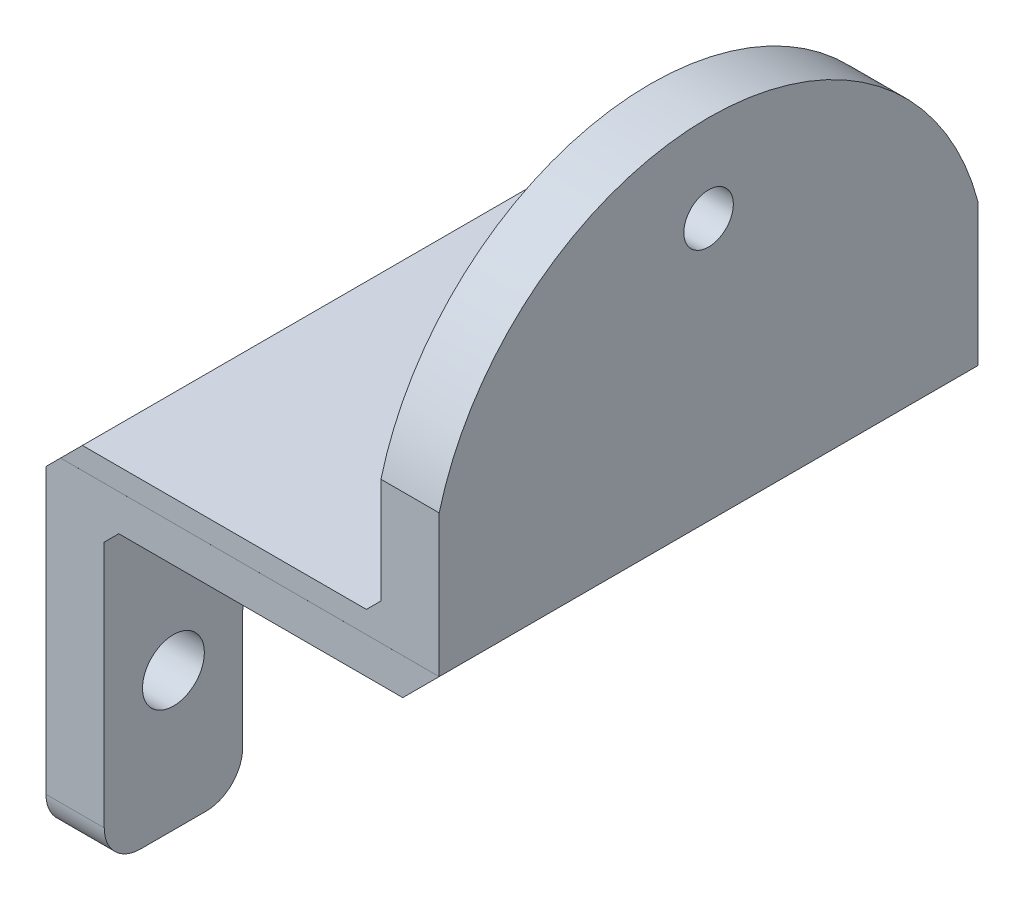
ISO-10303-21;
HEADER;
FILE_DESCRIPTION(('STEP AP214'),'2;1');
FILE_NAME('part.step','',(''),(''),'','','');
FILE_SCHEMA(('AUTOMOTIVE_DESIGN { 1 0 10303 214 1 1 1 1 }'));
ENDSEC;
DATA;
#1=APPLICATION_CONTEXT('core data for automotive mechanical design processes');
#2=APPLICATION_PROTOCOL_DEFINITION('international standard','automotive_design',2000,#1);
#3=PRODUCT_CONTEXT('',#1,'mechanical');
#4=PRODUCT('Part','Part','',(#3));
#5=PRODUCT_RELATED_PRODUCT_CATEGORY('part','',(#4));
#6=PRODUCT_DEFINITION_FORMATION('','',#4);
#7=PRODUCT_DEFINITION_CONTEXT('part definition',#1,'design');
#8=PRODUCT_DEFINITION('design','',#6,#7);
#9=PRODUCT_DEFINITION_SHAPE('','',#8);
#10=(LENGTH_UNIT() NAMED_UNIT(*) SI_UNIT(.MILLI.,.METRE.));
#11=(NAMED_UNIT(*) PLANE_ANGLE_UNIT() SI_UNIT($,.RADIAN.));
#12=(NAMED_UNIT(*) SI_UNIT($,.STERADIAN.) SOLID_ANGLE_UNIT());
#13=UNCERTAINTY_MEASURE_WITH_UNIT(LENGTH_MEASURE(1.E-05),#10,'distance_accuracy_value','');
#14=(GEOMETRIC_REPRESENTATION_CONTEXT(3) GLOBAL_UNCERTAINTY_ASSIGNED_CONTEXT((#13)) GLOBAL_UNIT_ASSIGNED_CONTEXT((#10,
#11,#12)) REPRESENTATION_CONTEXT('',''));
#15=CARTESIAN_POINT('',(0.,0.,0.));
#16=DIRECTION('',(0.,0.,1.));
#17=DIRECTION('',(1.,0.,0.));
#18=AXIS2_PLACEMENT_3D('',#15,#16,#17);
#19=CARTESIAN_POINT('',(54.,41.,37.));
#20=DIRECTION('',(-1.,0.,0.));
#21=DIRECTION('',(0.,0.,1.));
#22=AXIS2_PLACEMENT_3D('',#19,#20,#21);
#23=PLANE('',#22);
#24=CARTESIAN_POINT('',(54.,82.,0.));
#25=DIRECTION('',(1.,0.,0.));
#26=DIRECTION('',(0.,0.,-1.));
#27=AXIS2_PLACEMENT_3D('',#24,#25,#26);
#28=CIRCLE('',#27,3.39999999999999);
#29=CARTESIAN_POINT('',(54.,82.,-3.39999999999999));
#30=VERTEX_POINT('',#29);
#31=EDGE_CURVE('E325',#30,#30,#28,.T.);
#32=ORIENTED_EDGE('',*,*,#31,.F.);
#33=EDGE_LOOP('',(#32));
#34=FACE_BOUND('',#33,.T.);
#35=CARTESIAN_POINT('',(54.,55.74,0.));
#36=DIRECTION('',(-1.,0.,0.));
#37=DIRECTION('',(0.,0.,-1.));
#38=AXIS2_PLACEMENT_3D('',#35,#36,#37);
#39=CIRCLE('',#38,38.26);
#40=CARTESIAN_POINT('',(54.,65.4779463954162,37.));
#41=VERTEX_POINT('',#40);
#42=CARTESIAN_POINT('',(54.,65.4779463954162,-37.));
#43=VERTEX_POINT('',#42);
#44=EDGE_CURVE('E52',#41,#43,#39,.T.);
#45=ORIENTED_EDGE('',*,*,#44,.F.);
#46=DIRECTION('',(0.,1.,0.));
#47=VECTOR('',#46,1.);
#48=CARTESIAN_POINT('',(54.,41.,37.));
#49=LINE('',#48,#47);
#50=CARTESIAN_POINT('',(54.,46.0020536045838,37.));
#51=VERTEX_POINT('',#50);
#52=EDGE_CURVE('E374',#51,#41,#49,.T.);
#53=ORIENTED_EDGE('',*,*,#52,.F.);
#54=CARTESIAN_POINT('',(54.,46.,36.999459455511));
#55=VERTEX_POINT('',#54);
#56=EDGE_CURVE('E218',#55,#51,#39,.T.);
#57=ORIENTED_EDGE('',*,*,#56,.F.);
#58=DIRECTION('',(0.,0.,-1.));
#59=VECTOR('',#58,1.);
#60=CARTESIAN_POINT('',(54.,46.,37.));
#61=LINE('',#60,#59);
#62=CARTESIAN_POINT('',(54.,46.,-36.999459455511));
#63=VERTEX_POINT('',#62);
#64=EDGE_CURVE('E235',#55,#63,#61,.T.);
#65=ORIENTED_EDGE('',*,*,#64,.T.);
#66=CARTESIAN_POINT('',(54.,46.0020536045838,-37.));
#67=VERTEX_POINT('',#66);
#68=EDGE_CURVE('E497',#67,#63,#39,.T.);
#69=ORIENTED_EDGE('',*,*,#68,.F.);
#70=DIRECTION('',(0.,1.,0.));
#71=VECTOR('',#70,1.);
#72=CARTESIAN_POINT('',(54.,41.,-37.));
#73=LINE('',#72,#71);
#74=EDGE_CURVE('E313',#67,#43,#73,.T.);
#75=ORIENTED_EDGE('',*,*,#74,.T.);
#76=EDGE_LOOP('',(#45,#53,#57,#65,#69,#75));
#77=FACE_BOUND('',#76,.T.);
#78=ADVANCED_FACE('F37',(#34,#77),#23,.F.);
#79=CARTESIAN_POINT('',(46.,49.,37.));
#80=DIRECTION('',(1.,0.,0.));
#81=DIRECTION('',(0.,0.,-1.));
#82=AXIS2_PLACEMENT_3D('',#79,#80,#81);
#83=PLANE('',#82);
#84=CARTESIAN_POINT('',(46.,82.,0.));
#85=DIRECTION('',(1.,0.,0.));
#86=DIRECTION('',(0.,0.,-1.));
#87=AXIS2_PLACEMENT_3D('',#84,#85,#86);
#88=CIRCLE('',#87,3.39999999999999);
#89=CARTESIAN_POINT('',(46.,82.,-3.39999999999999));
#90=VERTEX_POINT('',#89);
#91=EDGE_CURVE('E329',#90,#90,#88,.T.);
#92=ORIENTED_EDGE('',*,*,#91,.T.);
#93=EDGE_LOOP('',(#92));
#94=FACE_BOUND('',#93,.T.);
#95=CARTESIAN_POINT('',(46.,55.74,0.));
#96=DIRECTION('',(1.,0.,0.));
#97=DIRECTION('',(0.,0.,-1.));
#98=AXIS2_PLACEMENT_3D('',#95,#96,#97);
#99=CIRCLE('',#98,38.26);
#100=CARTESIAN_POINT('',(46.,65.4779463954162,-37.));
#101=VERTEX_POINT('',#100);
#102=CARTESIAN_POINT('',(46.,65.4779463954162,37.));
#103=VERTEX_POINT('',#102);
#104=EDGE_CURVE('E323',#101,#103,#99,.T.);
#105=ORIENTED_EDGE('',*,*,#104,.F.);
#106=DIRECTION('',(0.,-1.,0.));
#107=VECTOR('',#106,1.);
#108=CARTESIAN_POINT('',(46.,49.,-37.));
#109=LINE('',#108,#107);
#110=CARTESIAN_POINT('',(46.,51.,-37.));
#111=VERTEX_POINT('',#110);
#112=EDGE_CURVE('E384',#101,#111,#109,.T.);
#113=ORIENTED_EDGE('',*,*,#112,.T.);
#114=DIRECTION('',(0.,0.,1.));
#115=VECTOR('',#114,1.);
#116=CARTESIAN_POINT('',(46.,51.,37.));
#117=LINE('',#116,#115);
#118=CARTESIAN_POINT('',(46.,51.,37.));
#119=VERTEX_POINT('',#118);
#120=EDGE_CURVE('E268',#111,#119,#117,.T.);
#121=ORIENTED_EDGE('',*,*,#120,.T.);
#122=DIRECTION('',(0.,-1.,0.));
#123=VECTOR('',#122,1.);
#124=CARTESIAN_POINT('',(46.,49.,37.));
#125=LINE('',#124,#123);
#126=EDGE_CURVE('E302',#103,#119,#125,.T.);
#127=ORIENTED_EDGE('',*,*,#126,.F.);
#128=EDGE_LOOP('',(#105,#113,#121,#127));
#129=FACE_BOUND('',#128,.T.);
#130=ADVANCED_FACE('F518',(#94,#129),#83,.F.);
#131=CARTESIAN_POINT('',(0.,0.,37.));
#132=DIRECTION('',(0.,0.,-1.));
#133=DIRECTION('',(-1.,0.,0.));
#134=AXIS2_PLACEMENT_3D('',#131,#132,#133);
#135=PLANE('',#134);
#136=DIRECTION('',(-1.,0.,0.));
#137=VECTOR('',#136,1.);
#138=CARTESIAN_POINT('',(54.,46.,37.));
#139=LINE('',#138,#137);
#140=CARTESIAN_POINT('',(54.,46.,37.));
#141=VERTEX_POINT('',#140);
#142=CARTESIAN_POINT('',(2.00000000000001,46.,37.));
#143=VERTEX_POINT('',#142);
#144=EDGE_CURVE('E208',#141,#143,#139,.T.);
#145=ORIENTED_EDGE('',*,*,#144,.T.);
#146=DIRECTION('',(0.707106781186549,0.707106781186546,0.));
#147=VECTOR('',#146,1.);
#148=CARTESIAN_POINT('',(0.,44.,37.));
#149=LINE('',#148,#147);
#150=CARTESIAN_POINT('',(0.,44.,37.));
#151=VERTEX_POINT('',#150);
#152=EDGE_CURVE('E250',#143,#151,#149,.F.);
#153=ORIENTED_EDGE('',*,*,#152,.T.);
#154=DIRECTION('',(0.,-1.,0.));
#155=VECTOR('',#154,1.);
#156=CARTESIAN_POINT('',(0.,0.,37.));
#157=LINE('',#156,#155);
#158=CARTESIAN_POINT('',(0.,5.,37.));
#159=VERTEX_POINT('',#158);
#160=EDGE_CURVE('E368',#151,#159,#157,.T.);
#161=ORIENTED_EDGE('',*,*,#160,.T.);
#162=DIRECTION('',(1.,0.,0.));
#163=VECTOR('',#162,1.);
#164=CARTESIAN_POINT('',(0.,5.,37.));
#165=LINE('',#164,#163);
#166=CARTESIAN_POINT('',(8.,5.,37.));
#167=VERTEX_POINT('',#166);
#168=EDGE_CURVE('E394',#159,#167,#165,.T.);
#169=ORIENTED_EDGE('',*,*,#168,.T.);
#170=DIRECTION('',(0.,1.,0.));
#171=VECTOR('',#170,1.);
#172=CARTESIAN_POINT('',(8.,0.,37.));
#173=LINE('',#172,#171);
#174=CARTESIAN_POINT('',(8.,39.,37.));
#175=VERTEX_POINT('',#174);
#176=EDGE_CURVE('E370',#167,#175,#173,.T.);
#177=ORIENTED_EDGE('',*,*,#176,.T.);
#178=DIRECTION('',(-0.70710678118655,-0.707106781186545,0.));
#179=VECTOR('',#178,1.);
#180=CARTESIAN_POINT('',(-15.5,15.5000000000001,37.));
#181=LINE('',#180,#179);
#182=CARTESIAN_POINT('',(10.,41.,37.));
#183=VERTEX_POINT('',#182);
#184=EDGE_CURVE('E273',#175,#183,#181,.F.);
#185=ORIENTED_EDGE('',*,*,#184,.T.);
#186=DIRECTION('',(1.,0.,0.));
#187=VECTOR('',#186,1.);
#188=CARTESIAN_POINT('',(8.,41.,37.));
#189=LINE('',#188,#187);
#190=CARTESIAN_POINT('',(49.,41.,37.));
#191=VERTEX_POINT('',#190);
#192=EDGE_CURVE('E224',#183,#191,#189,.T.);
#193=ORIENTED_EDGE('',*,*,#192,.T.);
#194=DIRECTION('',(-0.707106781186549,-0.707106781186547,0.));
#195=VECTOR('',#194,1.);
#196=CARTESIAN_POINT('',(54.,46.,37.));
#197=LINE('',#196,#195);
#198=EDGE_CURVE('E221',#191,#141,#197,.F.);
#199=ORIENTED_EDGE('',*,*,#198,.T.);
#200=EDGE_LOOP('',(#145,#153,#161,#169,#177,#185,#193,#199));
#201=FACE_BOUND('',#200,.T.);
#202=ADVANCED_FACE('F222',(#201),#135,.F.);
#203=DIRECTION('',(-1.,0.,0.));
#204=VECTOR('',#203,1.);
#205=CARTESIAN_POINT('',(54.,46.0020536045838,37.));
#206=LINE('',#205,#204);
#207=CARTESIAN_POINT('',(2.00205360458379,46.0020536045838,37.));
#208=VERTEX_POINT('',#207);
#209=EDGE_CURVE('E294',#51,#208,#206,.T.);
#210=ORIENTED_EDGE('',*,*,#209,.F.);
#211=ORIENTED_EDGE('',*,*,#52,.T.);
#212=DIRECTION('',(-1.,0.,0.));
#213=VECTOR('',#212,1.);
#214=CARTESIAN_POINT('',(54.,65.4779463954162,37.));
#215=LINE('',#214,#213);
#216=EDGE_CURVE('E322',#103,#41,#215,.F.);
#217=ORIENTED_EDGE('',*,*,#216,.F.);
#218=ORIENTED_EDGE('',*,*,#126,.T.);
#219=DIRECTION('',(0.70710678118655,0.707106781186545,0.));
#220=VECTOR('',#219,1.);
#221=CARTESIAN_POINT('',(-2.50000000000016,2.50000000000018,37.));
#222=LINE('',#221,#220);
#223=CARTESIAN_POINT('',(44.,49.,37.));
#224=VERTEX_POINT('',#223);
#225=EDGE_CURVE('E278',#119,#224,#222,.F.);
#226=ORIENTED_EDGE('',*,*,#225,.T.);
#227=DIRECTION('',(-1.,0.,0.));
#228=VECTOR('',#227,1.);
#229=CARTESIAN_POINT('',(0.,49.,37.));
#230=LINE('',#229,#228);
#231=CARTESIAN_POINT('',(5.00000000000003,49.,37.));
#232=VERTEX_POINT('',#231);
#233=EDGE_CURVE('E297',#224,#232,#230,.T.);
#234=ORIENTED_EDGE('',*,*,#233,.T.);
#235=EDGE_CURVE('E229',#232,#208,#149,.F.);
#236=ORIENTED_EDGE('',*,*,#235,.T.);
#237=EDGE_LOOP('',(#210,#211,#217,#218,#226,#234,#236));
#238=FACE_BOUND('',#237,.T.);
#239=ADVANCED_FACE('F292',(#238),#135,.F.);
#240=CARTESIAN_POINT('',(0.,0.,-37.));
#241=DIRECTION('',(0.,0.,-1.));
#242=DIRECTION('',(-1.,0.,0.));
#243=AXIS2_PLACEMENT_3D('',#240,#241,#242);
#244=PLANE('',#243);
#245=ORIENTED_EDGE('',*,*,#74,.F.);
#246=DIRECTION('',(-1.,0.,0.));
#247=VECTOR('',#246,1.);
#248=CARTESIAN_POINT('',(54.,46.0020536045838,-37.));
#249=LINE('',#248,#247);
#250=CARTESIAN_POINT('',(2.00205360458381,46.0020536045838,-37.));
#251=VERTEX_POINT('',#250);
#252=EDGE_CURVE('E217',#67,#251,#249,.T.);
#253=ORIENTED_EDGE('',*,*,#252,.T.);
#254=DIRECTION('',(-0.707106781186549,-0.707106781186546,0.));
#255=VECTOR('',#254,1.);
#256=CARTESIAN_POINT('',(-22.,22.0000000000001,-37.));
#257=LINE('',#256,#255);
#258=CARTESIAN_POINT('',(5.00000000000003,49.,-37.));
#259=VERTEX_POINT('',#258);
#260=EDGE_CURVE('E236',#251,#259,#257,.F.);
#261=ORIENTED_EDGE('',*,*,#260,.T.);
#262=DIRECTION('',(-1.,0.,0.));
#263=VECTOR('',#262,1.);
#264=CARTESIAN_POINT('',(0.,49.,-37.));
#265=LINE('',#264,#263);
#266=CARTESIAN_POINT('',(44.,49.,-37.));
#267=VERTEX_POINT('',#266);
#268=EDGE_CURVE('E307',#267,#259,#265,.T.);
#269=ORIENTED_EDGE('',*,*,#268,.F.);
#270=DIRECTION('',(-0.70710678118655,-0.707106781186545,0.));
#271=VECTOR('',#270,1.);
#272=CARTESIAN_POINT('',(44.,49.,-37.));
#273=LINE('',#272,#271);
#274=EDGE_CURVE('E275',#267,#111,#273,.F.);
#275=ORIENTED_EDGE('',*,*,#274,.T.);
#276=ORIENTED_EDGE('',*,*,#112,.F.);
#277=DIRECTION('',(-1.,0.,0.));
#278=VECTOR('',#277,1.);
#279=CARTESIAN_POINT('',(54.,65.4779463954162,-37.));
#280=LINE('',#279,#278);
#281=EDGE_CURVE('E317',#101,#43,#280,.F.);
#282=ORIENTED_EDGE('',*,*,#281,.T.);
#283=EDGE_LOOP('',(#245,#253,#261,#269,#275,#276,#282));
#284=FACE_BOUND('',#283,.T.);
#285=ADVANCED_FACE('F311',(#284),#244,.T.);
#286=CARTESIAN_POINT('',(0.,44.,-37.));
#287=VERTEX_POINT('',#286);
#288=CARTESIAN_POINT('',(2.00000000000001,46.,-37.));
#289=VERTEX_POINT('',#288);
#290=EDGE_CURVE('E238',#287,#289,#257,.F.);
#291=ORIENTED_EDGE('',*,*,#290,.T.);
#292=DIRECTION('',(-1.,0.,0.));
#293=VECTOR('',#292,1.);
#294=CARTESIAN_POINT('',(54.,46.,-37.));
#295=LINE('',#294,#293);
#296=CARTESIAN_POINT('',(54.,46.,-37.));
#297=VERTEX_POINT('',#296);
#298=EDGE_CURVE('E60',#297,#289,#295,.T.);
#299=ORIENTED_EDGE('',*,*,#298,.F.);
#300=DIRECTION('',(0.707106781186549,0.707106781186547,0.));
#301=VECTOR('',#300,1.);
#302=CARTESIAN_POINT('',(3.99999999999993,-3.99999999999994,-37.));
#303=LINE('',#302,#301);
#304=CARTESIAN_POINT('',(49.,41.,-37.));
#305=VERTEX_POINT('',#304);
#306=EDGE_CURVE('E245',#297,#305,#303,.F.);
#307=ORIENTED_EDGE('',*,*,#306,.T.);
#308=DIRECTION('',(1.,0.,0.));
#309=VECTOR('',#308,1.);
#310=CARTESIAN_POINT('',(8.,41.,-37.));
#311=LINE('',#310,#309);
#312=CARTESIAN_POINT('',(10.,41.,-37.));
#313=VERTEX_POINT('',#312);
#314=EDGE_CURVE('E381',#313,#305,#311,.T.);
#315=ORIENTED_EDGE('',*,*,#314,.F.);
#316=DIRECTION('',(0.70710678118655,0.707106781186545,0.));
#317=VECTOR('',#316,1.);
#318=CARTESIAN_POINT('',(10.,41.,-37.));
#319=LINE('',#318,#317);
#320=CARTESIAN_POINT('',(8.,39.,-37.));
#321=VERTEX_POINT('',#320);
#322=EDGE_CURVE('E271',#313,#321,#319,.F.);
#323=ORIENTED_EDGE('',*,*,#322,.T.);
#324=DIRECTION('',(0.,1.,0.));
#325=VECTOR('',#324,1.);
#326=CARTESIAN_POINT('',(8.,0.,-37.));
#327=LINE('',#326,#325);
#328=CARTESIAN_POINT('',(8.,5.,-37.));
#329=VERTEX_POINT('',#328);
#330=EDGE_CURVE('E378',#329,#321,#327,.T.);
#331=ORIENTED_EDGE('',*,*,#330,.F.);
#332=DIRECTION('',(1.,0.,0.));
#333=VECTOR('',#332,1.);
#334=CARTESIAN_POINT('',(0.,5.,-37.));
#335=LINE('',#334,#333);
#336=CARTESIAN_POINT('',(0.,5.,-37.));
#337=VERTEX_POINT('',#336);
#338=EDGE_CURVE('E240',#329,#337,#335,.F.);
#339=ORIENTED_EDGE('',*,*,#338,.T.);
#340=DIRECTION('',(0.,-1.,0.));
#341=VECTOR('',#340,1.);
#342=CARTESIAN_POINT('',(0.,0.,-37.));
#343=LINE('',#342,#341);
#344=EDGE_CURVE('E367',#287,#337,#343,.T.);
#345=ORIENTED_EDGE('',*,*,#344,.F.);
#346=EDGE_LOOP('',(#291,#299,#307,#315,#323,#331,#339,#345));
#347=FACE_BOUND('',#346,.T.);
#348=ADVANCED_FACE('F437',(#347),#244,.T.);
#349=CARTESIAN_POINT('',(0.,44.,37.));
#350=DIRECTION('',(0.707106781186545,-0.707106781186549,0.));
#351=DIRECTION('',(0.,0.,-1.));
#352=AXIS2_PLACEMENT_3D('',#349,#350,#351);
#353=PLANE('',#352);
#354=ORIENTED_EDGE('',*,*,#152,.F.);
#355=DIRECTION('',(-1.28368599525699E-11,-1.28368599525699E-11,1.));
#356=VECTOR('',#355,1.);
#357=CARTESIAN_POINT('',(2.00000000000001,46.,37.0000000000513));
#358=LINE('',#357,#356);
#359=CARTESIAN_POINT('',(2.00000000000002,46.,36.999459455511));
#360=VERTEX_POINT('',#359);
#361=EDGE_CURVE('E11',#143,#360,#358,.F.);
#362=ORIENTED_EDGE('',*,*,#361,.T.);
#363=CARTESIAN_POINT('',(11.7400000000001,55.74,0.));
#364=DIRECTION('',(0.707106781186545,-0.707106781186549,0.));
#365=DIRECTION('',(-0.707106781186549,-0.707106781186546,0.));
#366=AXIS2_PLACEMENT_3D('',#363,#364,#365);
#367=ELLIPSE('',#366,54.1078108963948,38.26);
#368=EDGE_CURVE('E45',#360,#208,#367,.F.);
#369=ORIENTED_EDGE('',*,*,#368,.T.);
#370=ORIENTED_EDGE('',*,*,#235,.F.);
#371=DIRECTION('',(0.,0.,1.));
#372=VECTOR('',#371,1.);
#373=CARTESIAN_POINT('',(5.00000000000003,49.,37.));
#374=LINE('',#373,#372);
#375=EDGE_CURVE('E255',#259,#232,#374,.T.);
#376=ORIENTED_EDGE('',*,*,#375,.F.);
#377=ORIENTED_EDGE('',*,*,#260,.F.);
#378=CARTESIAN_POINT('',(2.00000000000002,46.,-36.999459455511));
#379=VERTEX_POINT('',#378);
#380=EDGE_CURVE('E281',#251,#379,#367,.F.);
#381=ORIENTED_EDGE('',*,*,#380,.T.);
#382=DIRECTION('',(0.,0.,1.));
#383=VECTOR('',#382,1.);
#384=CARTESIAN_POINT('',(2.00000000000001,46.,37.));
#385=LINE('',#384,#383);
#386=EDGE_CURVE('E280',#379,#289,#385,.F.);
#387=ORIENTED_EDGE('',*,*,#386,.T.);
#388=ORIENTED_EDGE('',*,*,#290,.F.);
#389=DIRECTION('',(0.,0.,-1.));
#390=VECTOR('',#389,1.);
#391=CARTESIAN_POINT('',(0.,44.,37.));
#392=LINE('',#391,#390);
#393=EDGE_CURVE('E228',#151,#287,#392,.T.);
#394=ORIENTED_EDGE('',*,*,#393,.F.);
#395=EDGE_LOOP('',(#354,#362,#369,#370,#376,#377,#381,#387,#388,#394));
#396=FACE_BOUND('',#395,.T.);
#397=ADVANCED_FACE('F287',(#396),#353,.F.);
#398=CARTESIAN_POINT('',(8.,0.,37.));
#399=DIRECTION('',(-1.,0.,0.));
#400=DIRECTION('',(0.,0.,1.));
#401=AXIS2_PLACEMENT_3D('',#398,#399,#400);
#402=PLANE('',#401);
#403=CARTESIAN_POINT('',(8.,19.,-27.5));
#404=DIRECTION('',(1.,0.,0.));
#405=DIRECTION('',(0.,0.,-1.));
#406=AXIS2_PLACEMENT_3D('',#403,#404,#405);
#407=CIRCLE('',#406,4.25);
#408=CARTESIAN_POINT('',(8.,19.,-31.75));
#409=VERTEX_POINT('',#408);
#410=EDGE_CURVE('E361',#409,#409,#407,.T.);
#411=ORIENTED_EDGE('',*,*,#410,.F.);
#412=EDGE_LOOP('',(#411));
#413=FACE_BOUND('',#412,.T.);
#414=ORIENTED_EDGE('',*,*,#330,.T.);
#415=DIRECTION('',(0.,0.,1.));
#416=VECTOR('',#415,1.);
#417=CARTESIAN_POINT('',(8.,39.,37.));
#418=LINE('',#417,#416);
#419=CARTESIAN_POINT('',(8.,39.,0.));
#420=VERTEX_POINT('',#419);
#421=EDGE_CURVE('E263',#321,#420,#418,.T.);
#422=ORIENTED_EDGE('',*,*,#421,.T.);
#423=CARTESIAN_POINT('',(8.,21.,0.));
#424=DIRECTION('',(1.,0.,0.));
#425=DIRECTION('',(0.,0.,-1.));
#426=AXIS2_PLACEMENT_3D('',#423,#424,#425);
#427=CIRCLE('',#426,18.);
#428=CARTESIAN_POINT('',(8.,21.,-18.));
#429=VERTEX_POINT('',#428);
#430=EDGE_CURVE('E333',#429,#420,#427,.T.);
#431=ORIENTED_EDGE('',*,*,#430,.F.);
#432=DIRECTION('',(0.,1.,0.));
#433=VECTOR('',#432,1.);
#434=CARTESIAN_POINT('',(8.,21.,-18.));
#435=LINE('',#434,#433);
#436=CARTESIAN_POINT('',(8.,5.00000000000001,-18.));
#437=VERTEX_POINT('',#436);
#438=EDGE_CURVE('E339',#437,#429,#435,.T.);
#439=ORIENTED_EDGE('',*,*,#438,.F.);
#440=CARTESIAN_POINT('',(8.,5.,-23.));
#441=DIRECTION('',(-1.,0.,0.));
#442=DIRECTION('',(0.,0.,1.));
#443=AXIS2_PLACEMENT_3D('',#440,#441,#442);
#444=CIRCLE('',#443,5.);
#445=CARTESIAN_POINT('',(8.,0.,-23.));
#446=VERTEX_POINT('',#445);
#447=EDGE_CURVE('E399',#437,#446,#444,.F.);
#448=ORIENTED_EDGE('',*,*,#447,.T.);
#449=DIRECTION('',(0.,0.,-1.));
#450=VECTOR('',#449,1.);
#451=CARTESIAN_POINT('',(8.,0.,37.));
#452=LINE('',#451,#450);
#453=CARTESIAN_POINT('',(8.,0.,-32.));
#454=VERTEX_POINT('',#453);
#455=EDGE_CURVE('E301',#446,#454,#452,.T.);
#456=ORIENTED_EDGE('',*,*,#455,.T.);
#457=CARTESIAN_POINT('',(8.,5.,-32.));
#458=DIRECTION('',(-1.,0.,0.));
#459=DIRECTION('',(0.,0.,1.));
#460=AXIS2_PLACEMENT_3D('',#457,#458,#459);
#461=CIRCLE('',#460,5.);
#462=EDGE_CURVE('E397',#454,#329,#461,.F.);
#463=ORIENTED_EDGE('',*,*,#462,.T.);
#464=EDGE_LOOP('',(#414,#422,#431,#439,#448,#456,#463));
#465=FACE_BOUND('',#464,.T.);
#466=ADVANCED_FACE('F448',(#413,#465),#402,.F.);
#467=CARTESIAN_POINT('',(0.,0.,37.));
#468=DIRECTION('',(0.,1.,0.));
#469=DIRECTION('',(0.,0.,1.));
#470=AXIS2_PLACEMENT_3D('',#467,#468,#469);
#471=PLANE('',#470);
#472=ORIENTED_EDGE('',*,*,#455,.F.);
#473=DIRECTION('',(1.,0.,0.));
#474=VECTOR('',#473,1.);
#475=CARTESIAN_POINT('',(0.,0.,-23.));
#476=LINE('',#475,#474);
#477=CARTESIAN_POINT('',(0.,0.,-23.));
#478=VERTEX_POINT('',#477);
#479=EDGE_CURVE('E426',#446,#478,#476,.F.);
#480=ORIENTED_EDGE('',*,*,#479,.T.);
#481=DIRECTION('',(0.,0.,-1.));
#482=VECTOR('',#481,1.);
#483=CARTESIAN_POINT('',(0.,0.,37.));
#484=LINE('',#483,#482);
#485=CARTESIAN_POINT('',(0.,0.,-32.));
#486=VERTEX_POINT('',#485);
#487=EDGE_CURVE('E390',#478,#486,#484,.T.);
#488=ORIENTED_EDGE('',*,*,#487,.T.);
#489=DIRECTION('',(1.,0.,0.));
#490=VECTOR('',#489,1.);
#491=CARTESIAN_POINT('',(8.,0.,-32.));
#492=LINE('',#491,#490);
#493=EDGE_CURVE('E424',#486,#454,#492,.T.);
#494=ORIENTED_EDGE('',*,*,#493,.T.);
#495=EDGE_LOOP('',(#472,#480,#488,#494));
#496=FACE_BOUND('',#495,.T.);
#497=ADVANCED_FACE('F445',(#496),#471,.F.);
#498=CARTESIAN_POINT('',(0.,0.,37.));
#499=DIRECTION('',(1.,0.,0.));
#500=DIRECTION('',(0.,0.,-1.));
#501=AXIS2_PLACEMENT_3D('',#498,#499,#500);
#502=PLANE('',#501);
#503=CARTESIAN_POINT('',(0.,19.,27.5));
#504=DIRECTION('',(1.,0.,0.));
#505=DIRECTION('',(0.,0.,-1.));
#506=AXIS2_PLACEMENT_3D('',#503,#504,#505);
#507=CIRCLE('',#506,4.25);
#508=CARTESIAN_POINT('',(0.,19.,23.25));
#509=VERTEX_POINT('',#508);
#510=EDGE_CURVE('E358',#509,#509,#507,.T.);
#511=ORIENTED_EDGE('',*,*,#510,.T.);
#512=EDGE_LOOP('',(#511));
#513=FACE_BOUND('',#512,.T.);
#514=CARTESIAN_POINT('',(0.,19.,-27.5));
#515=DIRECTION('',(1.,0.,0.));
#516=DIRECTION('',(0.,0.,-1.));
#517=AXIS2_PLACEMENT_3D('',#514,#515,#516);
#518=CIRCLE('',#517,4.25);
#519=CARTESIAN_POINT('',(0.,19.,-31.75));
#520=VERTEX_POINT('',#519);
#521=EDGE_CURVE('E364',#520,#520,#518,.T.);
#522=ORIENTED_EDGE('',*,*,#521,.T.);
#523=EDGE_LOOP('',(#522));
#524=FACE_BOUND('',#523,.T.);
#525=ORIENTED_EDGE('',*,*,#160,.F.);
#526=ORIENTED_EDGE('',*,*,#393,.T.);
#527=ORIENTED_EDGE('',*,*,#344,.T.);
#528=CARTESIAN_POINT('',(0.,5.,-32.));
#529=DIRECTION('',(1.,0.,0.));
#530=DIRECTION('',(0.,0.,-1.));
#531=AXIS2_PLACEMENT_3D('',#528,#529,#530);
#532=CIRCLE('',#531,5.);
#533=EDGE_CURVE('E410',#337,#486,#532,.F.);
#534=ORIENTED_EDGE('',*,*,#533,.T.);
#535=ORIENTED_EDGE('',*,*,#487,.F.);
#536=CARTESIAN_POINT('',(0.,5.,-23.));
#537=DIRECTION('',(1.,0.,0.));
#538=DIRECTION('',(0.,0.,-1.));
#539=AXIS2_PLACEMENT_3D('',#536,#537,#538);
#540=CIRCLE('',#539,5.);
#541=CARTESIAN_POINT('',(0.,5.,-18.));
#542=VERTEX_POINT('',#541);
#543=EDGE_CURVE('E412',#478,#542,#540,.F.);
#544=ORIENTED_EDGE('',*,*,#543,.T.);
#545=DIRECTION('',(0.,1.,0.));
#546=VECTOR('',#545,1.);
#547=CARTESIAN_POINT('',(0.,0.,-18.));
#548=LINE('',#547,#546);
#549=CARTESIAN_POINT('',(0.,21.,-18.));
#550=VERTEX_POINT('',#549);
#551=EDGE_CURVE('E350',#542,#550,#548,.T.);
#552=ORIENTED_EDGE('',*,*,#551,.T.);
#553=CARTESIAN_POINT('',(0.,21.,0.));
#554=DIRECTION('',(1.,0.,0.));
#555=DIRECTION('',(0.,0.,-1.));
#556=AXIS2_PLACEMENT_3D('',#553,#554,#555);
#557=CIRCLE('',#556,18.);
#558=CARTESIAN_POINT('',(0.,21.,18.));
#559=VERTEX_POINT('',#558);
#560=EDGE_CURVE('E352',#550,#559,#557,.T.);
#561=ORIENTED_EDGE('',*,*,#560,.T.);
#562=DIRECTION('',(0.,-1.,0.));
#563=VECTOR('',#562,1.);
#564=CARTESIAN_POINT('',(0.,0.,18.));
#565=LINE('',#564,#563);
#566=CARTESIAN_POINT('',(0.,5.,18.));
#567=VERTEX_POINT('',#566);
#568=EDGE_CURVE('E345',#559,#567,#565,.T.);
#569=ORIENTED_EDGE('',*,*,#568,.T.);
#570=CARTESIAN_POINT('',(0.,5.,23.));
#571=DIRECTION('',(1.,0.,0.));
#572=DIRECTION('',(0.,0.,-1.));
#573=AXIS2_PLACEMENT_3D('',#570,#571,#572);
#574=CIRCLE('',#573,5.);
#575=CARTESIAN_POINT('',(0.,0.,23.));
#576=VERTEX_POINT('',#575);
#577=EDGE_CURVE('E414',#567,#576,#574,.F.);
#578=ORIENTED_EDGE('',*,*,#577,.T.);
#579=CARTESIAN_POINT('',(0.,0.,32.));
#580=VERTEX_POINT('',#579);
#581=EDGE_CURVE('E393',#580,#576,#484,.T.);
#582=ORIENTED_EDGE('',*,*,#581,.F.);
#583=CARTESIAN_POINT('',(0.,5.,32.));
#584=DIRECTION('',(1.,0.,0.));
#585=DIRECTION('',(0.,0.,-1.));
#586=AXIS2_PLACEMENT_3D('',#583,#584,#585);
#587=CIRCLE('',#586,5.);
#588=EDGE_CURVE('E416',#580,#159,#587,.F.);
#589=ORIENTED_EDGE('',*,*,#588,.T.);
#590=EDGE_LOOP('',(#525,#526,#527,#534,#535,#544,#552,#561,#569,#578,#582,#589));
#591=FACE_BOUND('',#590,.T.);
#592=ADVANCED_FACE('F443',(#513,#524,#591),#502,.F.);
#593=CARTESIAN_POINT('',(8.,0.,32.));
#594=VERTEX_POINT('',#593);
#595=CARTESIAN_POINT('',(8.,0.,23.));
#596=VERTEX_POINT('',#595);
#597=EDGE_CURVE('E387',#594,#596,#452,.T.);
#598=ORIENTED_EDGE('',*,*,#597,.F.);
#599=DIRECTION('',(1.,0.,0.));
#600=VECTOR('',#599,1.);
#601=CARTESIAN_POINT('',(0.,0.,32.));
#602=LINE('',#601,#600);
#603=EDGE_CURVE('E408',#594,#580,#602,.F.);
#604=ORIENTED_EDGE('',*,*,#603,.T.);
#605=ORIENTED_EDGE('',*,*,#581,.T.);
#606=DIRECTION('',(1.,0.,0.));
#607=VECTOR('',#606,1.);
#608=CARTESIAN_POINT('',(0.,0.,23.));
#609=LINE('',#608,#607);
#610=EDGE_CURVE('E405',#576,#596,#609,.T.);
#611=ORIENTED_EDGE('',*,*,#610,.T.);
#612=EDGE_LOOP('',(#598,#604,#605,#611));
#613=FACE_BOUND('',#612,.T.);
#614=ADVANCED_FACE('F476',(#613),#471,.F.);
#615=CARTESIAN_POINT('',(8.,19.,27.5));
#616=DIRECTION('',(1.,0.,0.));
#617=DIRECTION('',(0.,0.,-1.));
#618=AXIS2_PLACEMENT_3D('',#615,#616,#617);
#619=CIRCLE('',#618,4.25);
#620=CARTESIAN_POINT('',(8.,19.,23.25));
#621=VERTEX_POINT('',#620);
#622=EDGE_CURVE('E355',#621,#621,#619,.T.);
#623=ORIENTED_EDGE('',*,*,#622,.F.);
#624=EDGE_LOOP('',(#623));
#625=FACE_BOUND('',#624,.T.);
#626=CARTESIAN_POINT('',(8.,21.,18.));
#627=VERTEX_POINT('',#626);
#628=EDGE_CURVE('E332',#420,#627,#427,.T.);
#629=ORIENTED_EDGE('',*,*,#628,.F.);
#630=DIRECTION('',(0.,0.,1.));
#631=VECTOR('',#630,1.);
#632=CARTESIAN_POINT('',(8.,39.,37.));
#633=LINE('',#632,#631);
#634=EDGE_CURVE('E261',#420,#175,#633,.T.);
#635=ORIENTED_EDGE('',*,*,#634,.T.);
#636=ORIENTED_EDGE('',*,*,#176,.F.);
#637=CARTESIAN_POINT('',(8.,5.,32.));
#638=DIRECTION('',(-1.,0.,0.));
#639=DIRECTION('',(0.,0.,1.));
#640=AXIS2_PLACEMENT_3D('',#637,#638,#639);
#641=CIRCLE('',#640,5.);
#642=EDGE_CURVE('E403',#167,#594,#641,.F.);
#643=ORIENTED_EDGE('',*,*,#642,.T.);
#644=ORIENTED_EDGE('',*,*,#597,.T.);
#645=CARTESIAN_POINT('',(8.,5.,23.));
#646=DIRECTION('',(-1.,0.,0.));
#647=DIRECTION('',(0.,0.,1.));
#648=AXIS2_PLACEMENT_3D('',#645,#646,#647);
#649=CIRCLE('',#648,5.);
#650=CARTESIAN_POINT('',(8.,5.00000000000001,18.));
#651=VERTEX_POINT('',#650);
#652=EDGE_CURVE('E401',#596,#651,#649,.F.);
#653=ORIENTED_EDGE('',*,*,#652,.T.);
#654=DIRECTION('',(0.,-1.,0.));
#655=VECTOR('',#654,1.);
#656=CARTESIAN_POINT('',(8.,21.,18.));
#657=LINE('',#656,#655);
#658=EDGE_CURVE('E336',#627,#651,#657,.T.);
#659=ORIENTED_EDGE('',*,*,#658,.F.);
#660=EDGE_LOOP('',(#629,#635,#636,#643,#644,#653,#659));
#661=FACE_BOUND('',#660,.T.);
#662=ADVANCED_FACE('F468',(#625,#661),#402,.F.);
#663=CARTESIAN_POINT('',(8.,41.,37.));
#664=DIRECTION('',(0.,1.,0.));
#665=DIRECTION('',(0.,0.,1.));
#666=AXIS2_PLACEMENT_3D('',#663,#664,#665);
#667=PLANE('',#666);
#668=ORIENTED_EDGE('',*,*,#192,.F.);
#669=DIRECTION('',(0.,0.,-1.));
#670=VECTOR('',#669,1.);
#671=CARTESIAN_POINT('',(10.,41.,-37.));
#672=LINE('',#671,#670);
#673=EDGE_CURVE('E258',#183,#313,#672,.T.);
#674=ORIENTED_EDGE('',*,*,#673,.T.);
#675=ORIENTED_EDGE('',*,*,#314,.T.);
#676=DIRECTION('',(0.,0.,1.));
#677=VECTOR('',#676,1.);
#678=CARTESIAN_POINT('',(49.,41.,37.));
#679=LINE('',#678,#677);
#680=EDGE_CURVE('E248',#305,#191,#679,.T.);
#681=ORIENTED_EDGE('',*,*,#680,.T.);
#682=EDGE_LOOP('',(#668,#674,#675,#681));
#683=FACE_BOUND('',#682,.T.);
#684=ADVANCED_FACE('F491',(#683),#667,.F.);
#685=CARTESIAN_POINT('',(0.,49.,37.));
#686=DIRECTION('',(0.,-1.,0.));
#687=DIRECTION('',(0.,0.,-1.));
#688=AXIS2_PLACEMENT_3D('',#685,#686,#687);
#689=PLANE('',#688);
#690=ORIENTED_EDGE('',*,*,#233,.F.);
#691=DIRECTION('',(0.,0.,-1.));
#692=VECTOR('',#691,1.);
#693=CARTESIAN_POINT('',(44.,49.,-37.));
#694=LINE('',#693,#692);
#695=EDGE_CURVE('E265',#224,#267,#694,.T.);
#696=ORIENTED_EDGE('',*,*,#695,.T.);
#697=ORIENTED_EDGE('',*,*,#268,.T.);
#698=ORIENTED_EDGE('',*,*,#375,.T.);
#699=EDGE_LOOP('',(#690,#696,#697,#698));
#700=FACE_BOUND('',#699,.T.);
#701=ADVANCED_FACE('F305',(#700),#689,.F.);
#702=CARTESIAN_POINT('',(-22.,19.,-27.5));
#703=DIRECTION('',(1.,0.,0.));
#704=DIRECTION('',(0.,0.,-1.));
#705=AXIS2_PLACEMENT_3D('',#702,#703,#704);
#706=CYLINDRICAL_SURFACE('',#705,4.25);
#707=ORIENTED_EDGE('',*,*,#410,.T.);
#708=EDGE_LOOP('',(#707));
#709=FACE_BOUND('',#708,.T.);
#710=ORIENTED_EDGE('',*,*,#521,.F.);
#711=EDGE_LOOP('',(#710));
#712=FACE_BOUND('',#711,.T.);
#713=ADVANCED_FACE('F664',(#709,#712),#706,.F.);
#714=CARTESIAN_POINT('',(-22.,19.,27.5));
#715=DIRECTION('',(1.,0.,0.));
#716=DIRECTION('',(0.,0.,-1.));
#717=AXIS2_PLACEMENT_3D('',#714,#715,#716);
#718=CYLINDRICAL_SURFACE('',#717,4.25);
#719=ORIENTED_EDGE('',*,*,#622,.T.);
#720=EDGE_LOOP('',(#719));
#721=FACE_BOUND('',#720,.T.);
#722=ORIENTED_EDGE('',*,*,#510,.F.);
#723=EDGE_LOOP('',(#722));
#724=FACE_BOUND('',#723,.T.);
#725=ADVANCED_FACE('F661',(#721,#724),#718,.F.);
#726=CARTESIAN_POINT('',(-22.,21.,0.));
#727=DIRECTION('',(1.,0.,0.));
#728=DIRECTION('',(0.,0.,-1.));
#729=AXIS2_PLACEMENT_3D('',#726,#727,#728);
#730=CYLINDRICAL_SURFACE('',#729,18.);
#731=DIRECTION('',(1.,0.,0.));
#732=VECTOR('',#731,1.);
#733=CARTESIAN_POINT('',(-22.,21.,-18.));
#734=LINE('',#733,#732);
#735=EDGE_CURVE('E342',#550,#429,#734,.T.);
#736=ORIENTED_EDGE('',*,*,#735,.T.);
#737=ORIENTED_EDGE('',*,*,#430,.T.);
#738=ORIENTED_EDGE('',*,*,#628,.T.);
#739=DIRECTION('',(1.,0.,0.));
#740=VECTOR('',#739,1.);
#741=CARTESIAN_POINT('',(-22.,21.,18.));
#742=LINE('',#741,#740);
#743=EDGE_CURVE('E341',#559,#627,#742,.T.);
#744=ORIENTED_EDGE('',*,*,#743,.F.);
#745=ORIENTED_EDGE('',*,*,#560,.F.);
#746=EDGE_LOOP('',(#736,#737,#738,#744,#745));
#747=FACE_BOUND('',#746,.T.);
#748=ADVANCED_FACE('F461',(#747),#730,.F.);
#749=CARTESIAN_POINT('',(-22.,21.,-18.));
#750=DIRECTION('',(0.,0.,-1.));
#751=DIRECTION('',(0.,1.,0.));
#752=AXIS2_PLACEMENT_3D('',#749,#750,#751);
#753=PLANE('',#752);
#754=ORIENTED_EDGE('',*,*,#551,.F.);
#755=DIRECTION('',(1.,0.,0.));
#756=VECTOR('',#755,1.);
#757=CARTESIAN_POINT('',(-22.,5.,-18.));
#758=LINE('',#757,#756);
#759=EDGE_CURVE('E421',#542,#437,#758,.T.);
#760=ORIENTED_EDGE('',*,*,#759,.T.);
#761=ORIENTED_EDGE('',*,*,#438,.T.);
#762=ORIENTED_EDGE('',*,*,#735,.F.);
#763=EDGE_LOOP('',(#754,#760,#761,#762));
#764=FACE_BOUND('',#763,.T.);
#765=ADVANCED_FACE('F456',(#764),#753,.F.);
#766=CARTESIAN_POINT('',(-22.,21.,18.));
#767=DIRECTION('',(0.,0.,1.));
#768=DIRECTION('',(1.,0.,0.));
#769=AXIS2_PLACEMENT_3D('',#766,#767,#768);
#770=PLANE('',#769);
#771=ORIENTED_EDGE('',*,*,#658,.T.);
#772=DIRECTION('',(1.,0.,0.));
#773=VECTOR('',#772,1.);
#774=CARTESIAN_POINT('',(-22.,5.,18.));
#775=LINE('',#774,#773);
#776=EDGE_CURVE('E419',#651,#567,#775,.F.);
#777=ORIENTED_EDGE('',*,*,#776,.T.);
#778=ORIENTED_EDGE('',*,*,#568,.F.);
#779=ORIENTED_EDGE('',*,*,#743,.T.);
#780=EDGE_LOOP('',(#771,#777,#778,#779));
#781=FACE_BOUND('',#780,.T.);
#782=ADVANCED_FACE('F465',(#781),#770,.F.);
#783=CARTESIAN_POINT('',(0.,5.,32.));
#784=DIRECTION('',(1.,0.,0.));
#785=DIRECTION('',(0.,0.,-1.));
#786=AXIS2_PLACEMENT_3D('',#783,#784,#785);
#787=CYLINDRICAL_SURFACE('',#786,5.);
#788=ORIENTED_EDGE('',*,*,#588,.F.);
#789=ORIENTED_EDGE('',*,*,#603,.F.);
#790=ORIENTED_EDGE('',*,*,#642,.F.);
#791=ORIENTED_EDGE('',*,*,#168,.F.);
#792=EDGE_LOOP('',(#788,#789,#790,#791));
#793=FACE_BOUND('',#792,.T.);
#794=ADVANCED_FACE('F482',(#793),#787,.T.);
#795=CARTESIAN_POINT('',(0.,5.,23.));
#796=DIRECTION('',(1.,0.,0.));
#797=DIRECTION('',(0.,0.,-1.));
#798=AXIS2_PLACEMENT_3D('',#795,#796,#797);
#799=CYLINDRICAL_SURFACE('',#798,5.);
#800=ORIENTED_EDGE('',*,*,#577,.F.);
#801=ORIENTED_EDGE('',*,*,#776,.F.);
#802=ORIENTED_EDGE('',*,*,#652,.F.);
#803=ORIENTED_EDGE('',*,*,#610,.F.);
#804=EDGE_LOOP('',(#800,#801,#802,#803));
#805=FACE_BOUND('',#804,.T.);
#806=ADVANCED_FACE('F473',(#805),#799,.T.);
#807=CARTESIAN_POINT('',(-22.,5.,-23.));
#808=DIRECTION('',(1.,0.,0.));
#809=DIRECTION('',(0.,0.,-1.));
#810=AXIS2_PLACEMENT_3D('',#807,#808,#809);
#811=CYLINDRICAL_SURFACE('',#810,5.);
#812=ORIENTED_EDGE('',*,*,#543,.F.);
#813=ORIENTED_EDGE('',*,*,#479,.F.);
#814=ORIENTED_EDGE('',*,*,#447,.F.);
#815=ORIENTED_EDGE('',*,*,#759,.F.);
#816=EDGE_LOOP('',(#812,#813,#814,#815));
#817=FACE_BOUND('',#816,.T.);
#818=ADVANCED_FACE('F453',(#817),#811,.T.);
#819=CARTESIAN_POINT('',(0.,5.,-32.));
#820=DIRECTION('',(-1.,0.,0.));
#821=DIRECTION('',(0.,0.,1.));
#822=AXIS2_PLACEMENT_3D('',#819,#820,#821);
#823=CYLINDRICAL_SURFACE('',#822,5.);
#824=ORIENTED_EDGE('',*,*,#533,.F.);
#825=ORIENTED_EDGE('',*,*,#338,.F.);
#826=ORIENTED_EDGE('',*,*,#462,.F.);
#827=ORIENTED_EDGE('',*,*,#493,.F.);
#828=EDGE_LOOP('',(#824,#825,#826,#827));
#829=FACE_BOUND('',#828,.T.);
#830=ADVANCED_FACE('F440',(#829),#823,.T.);
#831=CARTESIAN_POINT('',(54.,82.,0.));
#832=DIRECTION('',(1.,0.,0.));
#833=DIRECTION('',(0.,0.,-1.));
#834=AXIS2_PLACEMENT_3D('',#831,#832,#833);
#835=CYLINDRICAL_SURFACE('',#834,3.39999999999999);
#836=ORIENTED_EDGE('',*,*,#31,.T.);
#837=EDGE_LOOP('',(#836));
#838=FACE_BOUND('',#837,.T.);
#839=ORIENTED_EDGE('',*,*,#91,.F.);
#840=EDGE_LOOP('',(#839));
#841=FACE_BOUND('',#840,.T.);
#842=ADVANCED_FACE('F548',(#838,#841),#835,.F.);
#843=CARTESIAN_POINT('',(54.,46.,37.));
#844=DIRECTION('',(-0.707106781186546,0.707106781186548,0.));
#845=DIRECTION('',(0.,0.,-1.));
#846=AXIS2_PLACEMENT_3D('',#843,#844,#845);
#847=PLANE('',#846);
#848=ORIENTED_EDGE('',*,*,#198,.F.);
#849=ORIENTED_EDGE('',*,*,#680,.F.);
#850=ORIENTED_EDGE('',*,*,#306,.F.);
#851=DIRECTION('',(0.,0.,-1.));
#852=VECTOR('',#851,1.);
#853=CARTESIAN_POINT('',(54.,46.,-36.999459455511));
#854=LINE('',#853,#852);
#855=EDGE_CURVE('E494',#63,#297,#854,.T.);
#856=ORIENTED_EDGE('',*,*,#855,.F.);
#857=ORIENTED_EDGE('',*,*,#64,.F.);
#858=EDGE_CURVE('E213',#141,#55,#61,.T.);
#859=ORIENTED_EDGE('',*,*,#858,.F.);
#860=EDGE_LOOP('',(#848,#849,#850,#856,#857,#859));
#861=FACE_BOUND('',#860,.T.);
#862=ADVANCED_FACE('F232',(#861),#847,.F.);
#863=CARTESIAN_POINT('',(10.,41.,37.));
#864=DIRECTION('',(0.707106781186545,-0.70710678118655,0.));
#865=DIRECTION('',(0.,0.,1.));
#866=AXIS2_PLACEMENT_3D('',#863,#864,#865);
#867=PLANE('',#866);
#868=ORIENTED_EDGE('',*,*,#634,.F.);
#869=ORIENTED_EDGE('',*,*,#421,.F.);
#870=ORIENTED_EDGE('',*,*,#322,.F.);
#871=ORIENTED_EDGE('',*,*,#673,.F.);
#872=ORIENTED_EDGE('',*,*,#184,.F.);
#873=EDGE_LOOP('',(#868,#869,#870,#871,#872));
#874=FACE_BOUND('',#873,.T.);
#875=ADVANCED_FACE('F488',(#874),#867,.T.);
#876=CARTESIAN_POINT('',(44.,49.,37.));
#877=DIRECTION('',(-0.707106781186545,0.70710678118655,0.));
#878=DIRECTION('',(0.,0.,1.));
#879=AXIS2_PLACEMENT_3D('',#876,#877,#878);
#880=PLANE('',#879);
#881=ORIENTED_EDGE('',*,*,#225,.F.);
#882=ORIENTED_EDGE('',*,*,#120,.F.);
#883=ORIENTED_EDGE('',*,*,#274,.F.);
#884=ORIENTED_EDGE('',*,*,#695,.F.);
#885=EDGE_LOOP('',(#881,#882,#883,#884));
#886=FACE_BOUND('',#885,.T.);
#887=ADVANCED_FACE('F39',(#886),#880,.T.);
#888=CARTESIAN_POINT('',(54.,46.,-36.999459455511));
#889=DIRECTION('',(0.,1.,0.));
#890=DIRECTION('',(0.,0.,1.));
#891=AXIS2_PLACEMENT_3D('',#888,#889,#890);
#892=PLANE('',#891);
#893=ORIENTED_EDGE('',*,*,#386,.F.);
#894=DIRECTION('',(-1.,0.,0.));
#895=VECTOR('',#894,1.);
#896=CARTESIAN_POINT('',(54.,46.,-36.999459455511));
#897=LINE('',#896,#895);
#898=EDGE_CURVE('E498',#63,#379,#897,.T.);
#899=ORIENTED_EDGE('',*,*,#898,.F.);
#900=ORIENTED_EDGE('',*,*,#855,.T.);
#901=ORIENTED_EDGE('',*,*,#298,.T.);
#902=EDGE_LOOP('',(#893,#899,#900,#901));
#903=FACE_BOUND('',#902,.T.);
#904=ADVANCED_FACE('F505',(#903),#892,.T.);
#905=CARTESIAN_POINT('',(54.,55.74,0.));
#906=DIRECTION('',(-1.,0.,0.));
#907=DIRECTION('',(0.,0.,1.));
#908=AXIS2_PLACEMENT_3D('',#905,#906,#907);
#909=CYLINDRICAL_SURFACE('',#908,38.26);
#910=ORIENTED_EDGE('',*,*,#252,.F.);
#911=ORIENTED_EDGE('',*,*,#68,.T.);
#912=ORIENTED_EDGE('',*,*,#898,.T.);
#913=ORIENTED_EDGE('',*,*,#380,.F.);
#914=EDGE_LOOP('',(#910,#911,#912,#913));
#915=FACE_BOUND('',#914,.T.);
#916=ADVANCED_FACE('F504',(#915),#909,.T.);
#917=ORIENTED_EDGE('',*,*,#56,.T.);
#918=ORIENTED_EDGE('',*,*,#209,.T.);
#919=ORIENTED_EDGE('',*,*,#368,.F.);
#920=DIRECTION('',(-1.,0.,0.));
#921=VECTOR('',#920,1.);
#922=CARTESIAN_POINT('',(54.,46.,36.999459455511));
#923=LINE('',#922,#921);
#924=EDGE_CURVE('E495',#55,#360,#923,.T.);
#925=ORIENTED_EDGE('',*,*,#924,.F.);
#926=EDGE_LOOP('',(#917,#918,#919,#925));
#927=FACE_BOUND('',#926,.T.);
#928=ADVANCED_FACE('F513',(#927),#909,.T.);
#929=CARTESIAN_POINT('',(54.,46.,37.));
#930=DIRECTION('',(0.,1.,1.28368599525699E-11));
#931=DIRECTION('',(0.,-1.28368599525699E-11,1.));
#932=AXIS2_PLACEMENT_3D('',#929,#930,#931);
#933=PLANE('',#932);
#934=ORIENTED_EDGE('',*,*,#361,.F.);
#935=ORIENTED_EDGE('',*,*,#144,.F.);
#936=ORIENTED_EDGE('',*,*,#858,.T.);
#937=ORIENTED_EDGE('',*,*,#924,.T.);
#938=EDGE_LOOP('',(#934,#935,#936,#937));
#939=FACE_BOUND('',#938,.T.);
#940=ADVANCED_FACE('F210',(#939),#933,.T.);
#941=ORIENTED_EDGE('',*,*,#44,.T.);
#942=ORIENTED_EDGE('',*,*,#281,.F.);
#943=ORIENTED_EDGE('',*,*,#104,.T.);
#944=ORIENTED_EDGE('',*,*,#216,.T.);
#945=EDGE_LOOP('',(#941,#942,#943,#944));
#946=FACE_BOUND('',#945,.T.);
#947=ADVANCED_FACE('F515',(#946),#909,.T.);
#948=CLOSED_SHELL('',(#78,#130,#202,#239,#285,#348,#397,#466,#497,#592,#614,#662,#684,#701,#713,
#725,#748,#765,#782,#794,#806,#818,#830,#842,#862,#875,#887,#904,#916,#928,#940,#947));
#949=MANIFOLD_SOLID_BREP('B2',#948);
#950=ADVANCED_BREP_SHAPE_REPRESENTATION('',(#18,#949),#14);
#951=SHAPE_DEFINITION_REPRESENTATION(#9,#950);
ENDSEC;
END-ISO-10303-21;
